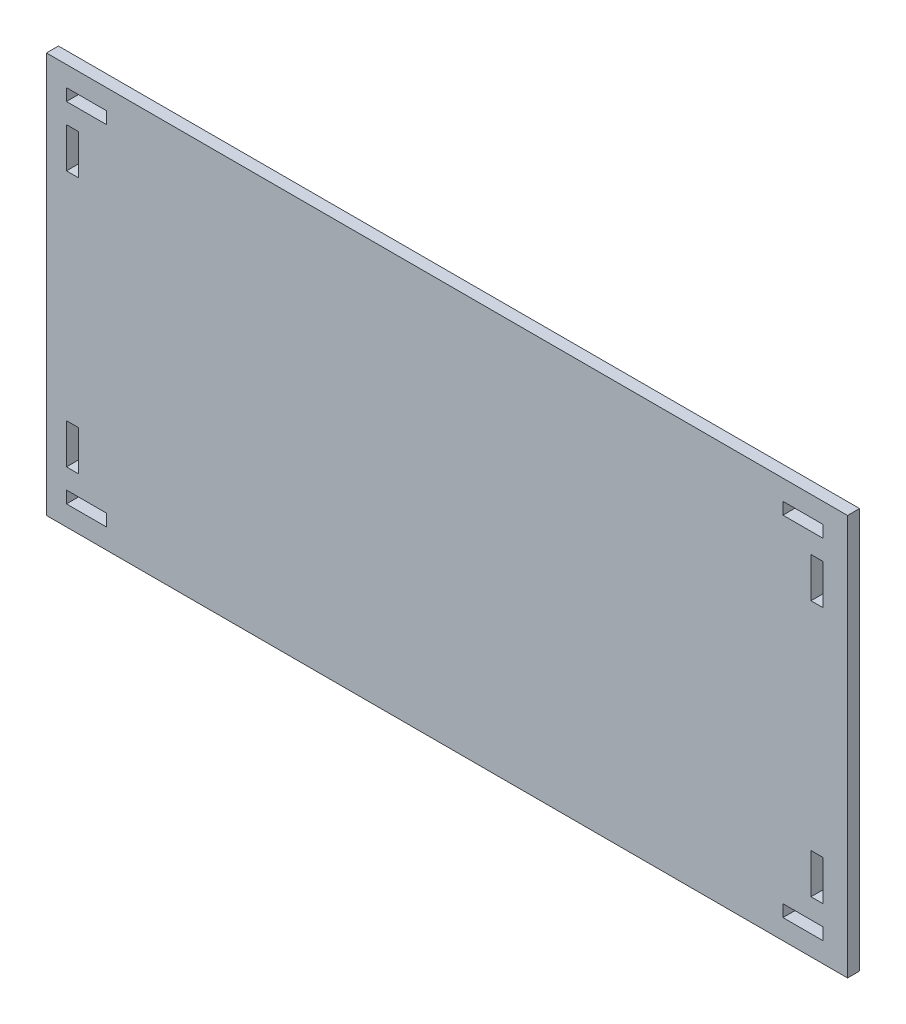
from build123d import *

# Parameters (mm, degrees)
ESBO_O1_W                = 200
ESBO_O1_H                = 100
ESBO_O1_W_2              = 10
ESBO_O1_H_2              = 3
ESBO_O1_W_3              = 3
ESBO_O1_H_3              = 10
RESSALTO_EXTRUS_O2_DEPTH = 3


with BuildPart() as part:
    # Esbo_o1 → Ressalto-extrus_o2 (new body)
    with BuildSketch(Plane.XY):
        with Locations((56.431841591, 27.328970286)):
            Rectangle(ESBO_O1_W, ESBO_O1_H)
        with Locations((-33.568158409, -16.171029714)):
            Rectangle(ESBO_O1_W_2, ESBO_O1_H_2, mode=Mode.SUBTRACT)
        with Locations((-33.568158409, 70.828970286)):
            Rectangle(ESBO_O1_W_2, ESBO_O1_H_2, mode=Mode.SUBTRACT)
        with Locations((145.303700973, 70.828970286)):
            Rectangle(ESBO_O1_W_2, ESBO_O1_H_2, mode=Mode.SUBTRACT)
        with Locations((145.303700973, -16.171029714)):
            Rectangle(ESBO_O1_W_2, ESBO_O1_H_2, mode=Mode.SUBTRACT)
        with Locations((-37.068158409, -4.671029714)):
            Rectangle(ESBO_O1_W_3, ESBO_O1_H_3, mode=Mode.SUBTRACT)
        with Locations((148.803700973, 59.328970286)):
            Rectangle(ESBO_O1_W_3, ESBO_O1_H_3, mode=Mode.SUBTRACT)
        with Locations((-37.068158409, 59.328970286)):
            Rectangle(ESBO_O1_W_3, ESBO_O1_H_3, mode=Mode.SUBTRACT)
        with Locations((148.803700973, -4.671029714)):
            Rectangle(ESBO_O1_W_3, ESBO_O1_H_3, mode=Mode.SUBTRACT)
    extrude(amount=RESSALTO_EXTRUS_O2_DEPTH)


solid = part.part
